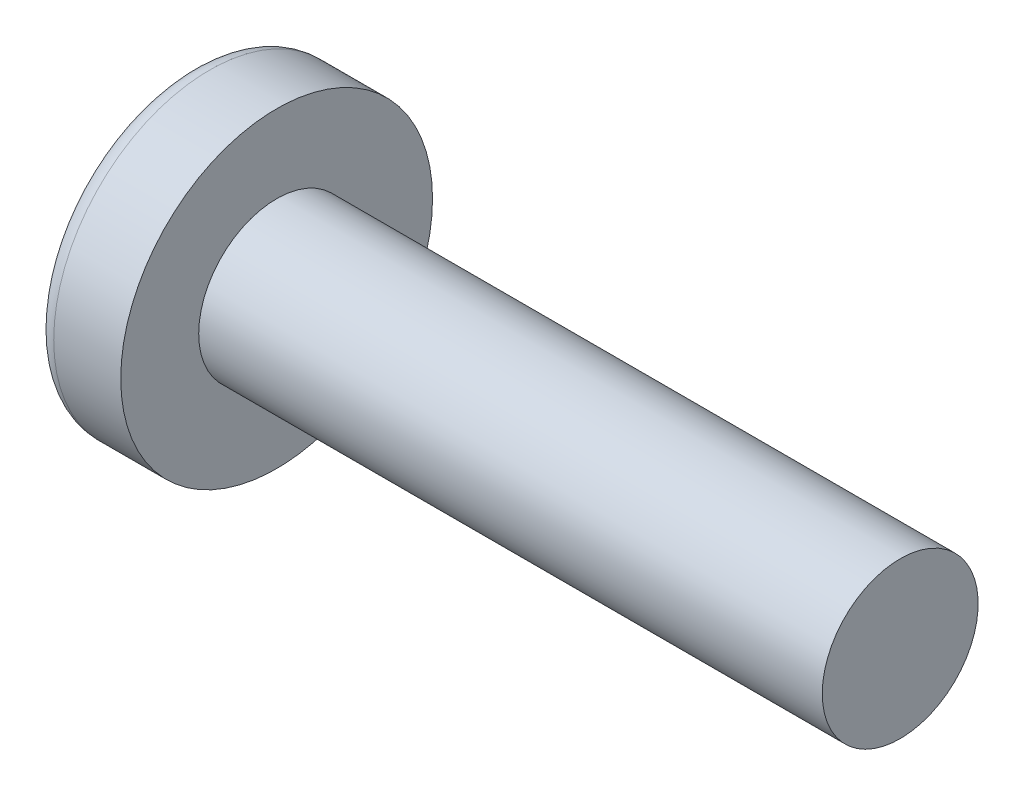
from build123d import *

# Parameters (mm, degrees)
CIRPATTERN1_COUNT = 2
CIRPATTERN1_ANGLE = 90


with BuildPart() as part:
    # BodySke → Base-Revolve (revolve)
    with BuildSketch(Plane.XY, mode=Mode.PRIVATE) as base_revolve_sk:
        with BuildLine():
            Line((2.1, 1.25), (2.1, 2.5))
            Line((2.1, 2.5), (1.025105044, 2.5))
            ThreePointArc((1.025105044, 2.5), (0.890037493, 2.467874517), (0.783897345, 2.378378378))
            ThreePointArc((0.783897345, 2.378378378), (0.201025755, 1.252116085), (0, 0))
            Line((0, 0), (12.1, 0))
            Line((12.1, 0), (12.1, 1.25))
            Line((12.1, 1.25), (2.1, 1.25))
        make_face()
    revolve(base_revolve_sk.sketch.rotate(Axis((-25.4, 0, 0), (1, 0, 0)), 90), axis=Axis((-25.4, 0, 0), (1, 0, 0)))

    # Sketch3 → Cut-Loft1 section 0
    with BuildSketch(Plane(origin=(0, 0, 0), x_dir=(0, 0, -1), z_dir=(1, 0, 0))):
        with BuildLine():
            Line((0.35, -1.34), (-0.35, -1.34))
            Line((-0.35, -1.34), (-0.35, 1.34))
            Line((-0.35, 1.34), (0.35, 1.34))
            Line((0.35, 1.34), (0.35, -1.34))
        make_face()
    # Sketch4 → Cut-Loft1 section 1
    with BuildSketch(Plane(origin=(1.53, 0, 0), x_dir=(0, 0, -1), z_dir=(1, 0, 0))):
        with BuildLine():
            Line((0.175, -0.175), (-0.175, -0.175))
            Line((-0.175, -0.175), (-0.175, 0.175))
            Line((-0.175, 0.175), (0.175, 0.175))
            Line((0.175, 0.175), (0.175, -0.175))
        make_face()
    cut_loft1 = loft(mode=Mode.SUBTRACT)

    # CirPattern1: Cut-Loft1 ×2 about axis
    cirpattern1_axis = Axis((0, 0, 0), (1, 0, 0))
    for i in range(1, CIRPATTERN1_COUNT):
        add(cut_loft1.rotate(cirpattern1_axis, i * CIRPATTERN1_ANGLE / (CIRPATTERN1_COUNT - 1)), mode=Mode.SUBTRACT)


solid = part.part
